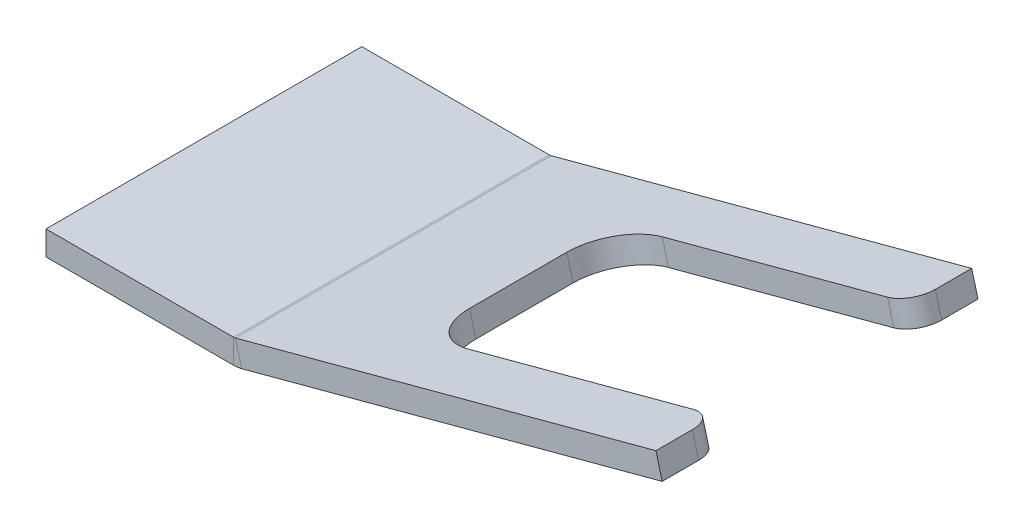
ISO-10303-21;
HEADER;
FILE_DESCRIPTION(('STEP AP214'),'2;1');
FILE_NAME('part.step','',(''),(''),'','','');
FILE_SCHEMA(('AUTOMOTIVE_DESIGN { 1 0 10303 214 1 1 1 1 }'));
ENDSEC;
DATA;
#1=APPLICATION_CONTEXT('core data for automotive mechanical design processes');
#2=APPLICATION_PROTOCOL_DEFINITION('international standard','automotive_design',2000,#1);
#3=PRODUCT_CONTEXT('',#1,'mechanical');
#4=PRODUCT('Part','Part','',(#3));
#5=PRODUCT_RELATED_PRODUCT_CATEGORY('part','',(#4));
#6=PRODUCT_DEFINITION_FORMATION('','',#4);
#7=PRODUCT_DEFINITION_CONTEXT('part definition',#1,'design');
#8=PRODUCT_DEFINITION('design','',#6,#7);
#9=PRODUCT_DEFINITION_SHAPE('','',#8);
#10=(LENGTH_UNIT() NAMED_UNIT(*) SI_UNIT(.MILLI.,.METRE.));
#11=(NAMED_UNIT(*) PLANE_ANGLE_UNIT() SI_UNIT($,.RADIAN.));
#12=(NAMED_UNIT(*) SI_UNIT($,.STERADIAN.) SOLID_ANGLE_UNIT());
#13=UNCERTAINTY_MEASURE_WITH_UNIT(LENGTH_MEASURE(1.E-05),#10,'distance_accuracy_value','');
#14=(GEOMETRIC_REPRESENTATION_CONTEXT(3) GLOBAL_UNCERTAINTY_ASSIGNED_CONTEXT((#13)) GLOBAL_UNIT_ASSIGNED_CONTEXT((#10,
#11,#12)) REPRESENTATION_CONTEXT('',''));
#15=CARTESIAN_POINT('',(0.,0.,0.));
#16=DIRECTION('',(0.,0.,1.));
#17=DIRECTION('',(1.,0.,0.));
#18=AXIS2_PLACEMENT_3D('',#15,#16,#17);
#19=CARTESIAN_POINT('',(57.5140017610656,17.1194629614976,-25.));
#20=DIRECTION('',(-0.258819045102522,0.965925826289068,0.));
#21=DIRECTION('',(0.,0.,1.));
#22=AXIS2_PLACEMENT_3D('',#19,#20,#21);
#23=PLANE('',#22);
#24=DIRECTION('',(0.965925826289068,0.258819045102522,0.));
#25=VECTOR('',#24,1.);
#26=CARTESIAN_POINT('',(-62.2608006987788,-14.9740986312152,32.5));
#27=LINE('',#26,#25);
#28=CARTESIAN_POINT('',(-24.2103752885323,-4.77851787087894,32.5));
#29=VERTEX_POINT('',#28);
#30=CARTESIAN_POINT('',(62.343630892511,18.4135581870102,32.5));
#31=VERTEX_POINT('',#30);
#32=EDGE_CURVE('E52',#29,#31,#27,.T.);
#33=ORIENTED_EDGE('',*,*,#32,.F.);
#34=DIRECTION('',(0.,0.,-1.));
#35=VECTOR('',#34,1.);
#36=CARTESIAN_POINT('',(-24.2103752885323,-4.77851787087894,-25.));
#37=LINE('',#36,#35);
#38=CARTESIAN_POINT('',(-24.2103752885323,-4.77851787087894,-32.5));
#39=VERTEX_POINT('',#38);
#40=EDGE_CURVE('E189',#29,#39,#37,.T.);
#41=ORIENTED_EDGE('',*,*,#40,.T.);
#42=DIRECTION('',(-0.965925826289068,-0.258819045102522,0.));
#43=VECTOR('',#42,1.);
#44=CARTESIAN_POINT('',(-62.2608006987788,-14.9740986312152,-32.5));
#45=LINE('',#44,#43);
#46=CARTESIAN_POINT('',(62.343630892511,18.4135581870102,-32.5));
#47=VERTEX_POINT('',#46);
#48=EDGE_CURVE('E253',#47,#39,#45,.T.);
#49=ORIENTED_EDGE('',*,*,#48,.F.);
#50=DIRECTION('',(0.,0.,-1.));
#51=VECTOR('',#50,1.);
#52=CARTESIAN_POINT('',(62.343630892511,18.4135581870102,-32.5));
#53=LINE('',#52,#51);
#54=CARTESIAN_POINT('',(62.343630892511,18.4135581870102,-25.));
#55=VERTEX_POINT('',#54);
#56=EDGE_CURVE('E249',#55,#47,#53,.T.);
#57=ORIENTED_EDGE('',*,*,#56,.F.);
#58=CARTESIAN_POINT('',(57.5140017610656,17.1194629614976,-25.));
#59=DIRECTION('',(-0.258819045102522,0.965925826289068,0.));
#60=DIRECTION('',(0.,0.,1.));
#61=AXIS2_PLACEMENT_3D('',#58,#59,#60);
#62=CIRCLE('',#61,5.);
#63=CARTESIAN_POINT('',(57.5140017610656,17.1194629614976,-20.));
#64=VERTEX_POINT('',#63);
#65=EDGE_CURVE('E245',#64,#55,#62,.T.);
#66=ORIENTED_EDGE('',*,*,#65,.F.);
#67=DIRECTION('',(0.965925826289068,0.258819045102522,0.));
#68=VECTOR('',#67,1.);
#69=CARTESIAN_POINT('',(57.5140017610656,17.1194629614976,-20.));
#70=LINE('',#69,#68);
#71=CARTESIAN_POINT('',(11.1495620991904,4.69614879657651,-20.));
#72=VERTEX_POINT('',#71);
#73=EDGE_CURVE('E241',#72,#64,#70,.T.);
#74=ORIENTED_EDGE('',*,*,#73,.F.);
#75=CARTESIAN_POINT('',(11.1495620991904,4.69614879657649,-10.));
#76=DIRECTION('',(0.258819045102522,-0.965925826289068,0.));
#77=DIRECTION('',(0.,0.,-1.));
#78=AXIS2_PLACEMENT_3D('',#75,#76,#77);
#79=CIRCLE('',#78,10.);
#80=CARTESIAN_POINT('',(1.49030383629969,2.10795834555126,-9.99999999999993));
#81=VERTEX_POINT('',#80);
#82=EDGE_CURVE('E237',#81,#72,#79,.T.);
#83=ORIENTED_EDGE('',*,*,#82,.F.);
#84=DIRECTION('',(0.,0.,-1.));
#85=VECTOR('',#84,1.);
#86=CARTESIAN_POINT('',(1.49030383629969,2.10795834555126,-9.99999999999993));
#87=LINE('',#86,#85);
#88=CARTESIAN_POINT('',(1.49030383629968,2.10795834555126,9.99999999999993));
#89=VERTEX_POINT('',#88);
#90=EDGE_CURVE('E233',#89,#81,#87,.T.);
#91=ORIENTED_EDGE('',*,*,#90,.F.);
#92=CARTESIAN_POINT('',(11.1495620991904,4.69614879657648,10.));
#93=DIRECTION('',(0.258819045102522,-0.965925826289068,0.));
#94=DIRECTION('',(0.,0.,1.));
#95=AXIS2_PLACEMENT_3D('',#92,#93,#94);
#96=CIRCLE('',#95,10.);
#97=CARTESIAN_POINT('',(11.1495620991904,4.69614879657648,20.));
#98=VERTEX_POINT('',#97);
#99=EDGE_CURVE('E229',#98,#89,#96,.T.);
#100=ORIENTED_EDGE('',*,*,#99,.F.);
#101=DIRECTION('',(-0.965925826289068,-0.258819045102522,0.));
#102=VECTOR('',#101,1.);
#103=CARTESIAN_POINT('',(57.5140017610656,17.1194629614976,20.));
#104=LINE('',#103,#102);
#105=CARTESIAN_POINT('',(57.5140017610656,17.1194629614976,20.));
#106=VERTEX_POINT('',#105);
#107=EDGE_CURVE('E225',#106,#98,#104,.T.);
#108=ORIENTED_EDGE('',*,*,#107,.F.);
#109=CARTESIAN_POINT('',(57.5140017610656,17.1194629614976,25.));
#110=DIRECTION('',(-0.258819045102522,0.965925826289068,0.));
#111=DIRECTION('',(0.,0.,1.));
#112=AXIS2_PLACEMENT_3D('',#109,#110,#111);
#113=CIRCLE('',#112,5.);
#114=CARTESIAN_POINT('',(62.343630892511,18.4135581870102,25.));
#115=VERTEX_POINT('',#114);
#116=EDGE_CURVE('E221',#115,#106,#113,.T.);
#117=ORIENTED_EDGE('',*,*,#116,.F.);
#118=DIRECTION('',(0.,0.,-1.));
#119=VECTOR('',#118,1.);
#120=CARTESIAN_POINT('',(62.343630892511,18.4135581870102,25.));
#121=LINE('',#120,#119);
#122=EDGE_CURVE('E217',#31,#115,#121,.T.);
#123=ORIENTED_EDGE('',*,*,#122,.F.);
#124=EDGE_LOOP('',(#33,#41,#49,#57,#66,#74,#83,#91,#100,#108,#117,#123));
#125=FACE_BOUND('',#124,.T.);
#126=ADVANCED_FACE('F48',(#125),#23,.F.);
#127=CARTESIAN_POINT('',(62.343630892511,18.4135581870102,25.));
#128=DIRECTION('',(0.965925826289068,0.258819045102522,0.));
#129=DIRECTION('',(0.,0.,-1.));
#130=AXIS2_PLACEMENT_3D('',#127,#128,#129);
#131=PLANE('',#130);
#132=DIRECTION('',(0.,0.,-1.));
#133=VECTOR('',#132,1.);
#134=CARTESIAN_POINT('',(61.0495356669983,23.2431873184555,25.));
#135=LINE('',#134,#133);
#136=CARTESIAN_POINT('',(61.0495356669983,23.2431873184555,32.5));
#137=VERTEX_POINT('',#136);
#138=CARTESIAN_POINT('',(61.0495356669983,23.2431873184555,25.));
#139=VERTEX_POINT('',#138);
#140=EDGE_CURVE('E254',#137,#139,#135,.T.);
#141=ORIENTED_EDGE('',*,*,#140,.F.);
#142=DIRECTION('',(-0.258819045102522,0.965925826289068,0.));
#143=VECTOR('',#142,1.);
#144=CARTESIAN_POINT('',(62.343630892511,18.4135581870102,32.5));
#145=LINE('',#144,#143);
#146=EDGE_CURVE('E290',#31,#137,#145,.T.);
#147=ORIENTED_EDGE('',*,*,#146,.F.);
#148=ORIENTED_EDGE('',*,*,#122,.T.);
#149=DIRECTION('',(-0.258819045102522,0.965925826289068,0.));
#150=VECTOR('',#149,1.);
#151=CARTESIAN_POINT('',(62.343630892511,18.4135581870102,25.));
#152=LINE('',#151,#150);
#153=EDGE_CURVE('E316',#115,#139,#152,.T.);
#154=ORIENTED_EDGE('',*,*,#153,.T.);
#155=EDGE_LOOP('',(#141,#147,#148,#154));
#156=FACE_BOUND('',#155,.T.);
#157=ADVANCED_FACE('F336',(#156),#131,.T.);
#158=CARTESIAN_POINT('',(-62.2608006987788,-14.9740986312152,32.5));
#159=DIRECTION('',(0.,0.,1.));
#160=DIRECTION('',(0.965925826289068,0.258819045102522,0.));
#161=AXIS2_PLACEMENT_3D('',#158,#159,#160);
#162=PLANE('',#161);
#163=DIRECTION('',(-0.258819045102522,0.965925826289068,0.));
#164=VECTOR('',#163,1.);
#165=CARTESIAN_POINT('',(-24.2103752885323,-4.77851787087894,32.5));
#166=LINE('',#165,#164);
#167=CARTESIAN_POINT('',(-25.504470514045,0.0511112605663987,32.5));
#168=VERTEX_POINT('',#167);
#169=EDGE_CURVE('E321',#29,#168,#166,.T.);
#170=ORIENTED_EDGE('',*,*,#169,.F.);
#171=ORIENTED_EDGE('',*,*,#32,.T.);
#172=ORIENTED_EDGE('',*,*,#146,.T.);
#173=DIRECTION('',(0.965925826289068,0.258819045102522,0.));
#174=VECTOR('',#173,1.);
#175=CARTESIAN_POINT('',(-63.5548959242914,-10.1444694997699,32.5));
#176=LINE('',#175,#174);
#177=EDGE_CURVE('E74',#168,#137,#176,.T.);
#178=ORIENTED_EDGE('',*,*,#177,.F.);
#179=EDGE_LOOP('',(#170,#171,#172,#178));
#180=FACE_BOUND('',#179,.T.);
#181=ADVANCED_FACE('F333',(#180),#162,.T.);
#182=CARTESIAN_POINT('',(-62.2608006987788,-14.9740986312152,-32.5));
#183=DIRECTION('',(0.,0.,-1.));
#184=DIRECTION('',(-0.965925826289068,-0.258819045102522,0.));
#185=AXIS2_PLACEMENT_3D('',#182,#183,#184);
#186=PLANE('',#185);
#187=DIRECTION('',(0.258819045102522,-0.965925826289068,0.));
#188=VECTOR('',#187,1.);
#189=CARTESIAN_POINT('',(-24.2103752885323,-4.77851787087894,-32.5));
#190=LINE('',#189,#188);
#191=CARTESIAN_POINT('',(-25.504470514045,0.051111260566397,-32.5));
#192=VERTEX_POINT('',#191);
#193=EDGE_CURVE('E12',#192,#39,#190,.T.);
#194=ORIENTED_EDGE('',*,*,#193,.F.);
#195=DIRECTION('',(-0.965925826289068,-0.258819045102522,0.));
#196=VECTOR('',#195,1.);
#197=CARTESIAN_POINT('',(-63.5548959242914,-10.1444694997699,-32.5));
#198=LINE('',#197,#196);
#199=CARTESIAN_POINT('',(61.0495356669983,23.2431873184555,-32.5));
#200=VERTEX_POINT('',#199);
#201=EDGE_CURVE('E66',#200,#192,#198,.T.);
#202=ORIENTED_EDGE('',*,*,#201,.F.);
#203=DIRECTION('',(-0.258819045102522,0.965925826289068,0.));
#204=VECTOR('',#203,1.);
#205=CARTESIAN_POINT('',(62.343630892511,18.4135581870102,-32.5));
#206=LINE('',#205,#204);
#207=EDGE_CURVE('E293',#47,#200,#206,.T.);
#208=ORIENTED_EDGE('',*,*,#207,.F.);
#209=ORIENTED_EDGE('',*,*,#48,.T.);
#210=EDGE_LOOP('',(#194,#202,#208,#209));
#211=FACE_BOUND('',#210,.T.);
#212=ADVANCED_FACE('F50',(#211),#186,.T.);
#213=CARTESIAN_POINT('',(62.343630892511,18.4135581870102,-32.5));
#214=DIRECTION('',(0.965925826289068,0.258819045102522,0.));
#215=DIRECTION('',(0.,0.,-1.));
#216=AXIS2_PLACEMENT_3D('',#213,#214,#215);
#217=PLANE('',#216);
#218=DIRECTION('',(0.,0.,-1.));
#219=VECTOR('',#218,1.);
#220=CARTESIAN_POINT('',(61.0495356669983,23.2431873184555,-32.5));
#221=LINE('',#220,#219);
#222=CARTESIAN_POINT('',(61.0495356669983,23.2431873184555,-25.));
#223=VERTEX_POINT('',#222);
#224=EDGE_CURVE('E287',#223,#200,#221,.T.);
#225=ORIENTED_EDGE('',*,*,#224,.F.);
#226=DIRECTION('',(-0.258819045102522,0.965925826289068,0.));
#227=VECTOR('',#226,1.);
#228=CARTESIAN_POINT('',(62.343630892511,18.4135581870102,-25.));
#229=LINE('',#228,#227);
#230=EDGE_CURVE('E296',#55,#223,#229,.T.);
#231=ORIENTED_EDGE('',*,*,#230,.F.);
#232=ORIENTED_EDGE('',*,*,#56,.T.);
#233=ORIENTED_EDGE('',*,*,#207,.T.);
#234=EDGE_LOOP('',(#225,#231,#232,#233));
#235=FACE_BOUND('',#234,.T.);
#236=ADVANCED_FACE('F367',(#235),#217,.T.);
#237=CARTESIAN_POINT('',(57.5140017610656,17.1194629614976,-25.));
#238=DIRECTION('',(-0.258819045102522,0.965925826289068,0.));
#239=DIRECTION('',(0.,0.,1.));
#240=AXIS2_PLACEMENT_3D('',#237,#238,#239);
#241=CYLINDRICAL_SURFACE('',#240,5.);
#242=CARTESIAN_POINT('',(56.219906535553,21.9490920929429,-25.));
#243=DIRECTION('',(-0.258819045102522,0.965925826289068,0.));
#244=DIRECTION('',(0.,0.,1.));
#245=AXIS2_PLACEMENT_3D('',#242,#243,#244);
#246=CIRCLE('',#245,5.);
#247=CARTESIAN_POINT('',(56.219906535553,21.9490920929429,-20.));
#248=VERTEX_POINT('',#247);
#249=EDGE_CURVE('E283',#248,#223,#246,.T.);
#250=ORIENTED_EDGE('',*,*,#249,.F.);
#251=DIRECTION('',(-0.258819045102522,0.965925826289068,0.));
#252=VECTOR('',#251,1.);
#253=CARTESIAN_POINT('',(57.5140017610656,17.1194629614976,-20.));
#254=LINE('',#253,#252);
#255=EDGE_CURVE('E299',#64,#248,#254,.T.);
#256=ORIENTED_EDGE('',*,*,#255,.F.);
#257=ORIENTED_EDGE('',*,*,#65,.T.);
#258=ORIENTED_EDGE('',*,*,#230,.T.);
#259=EDGE_LOOP('',(#250,#256,#257,#258));
#260=FACE_BOUND('',#259,.T.);
#261=ADVANCED_FACE('F364',(#260),#241,.T.);
#262=CARTESIAN_POINT('',(57.5140017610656,17.1194629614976,-20.));
#263=DIRECTION('',(0.,0.,1.));
#264=DIRECTION('',(0.965925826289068,0.258819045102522,0.));
#265=AXIS2_PLACEMENT_3D('',#262,#263,#264);
#266=PLANE('',#265);
#267=DIRECTION('',(0.965925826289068,0.258819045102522,0.));
#268=VECTOR('',#267,1.);
#269=CARTESIAN_POINT('',(56.219906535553,21.9490920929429,-20.));
#270=LINE('',#269,#268);
#271=CARTESIAN_POINT('',(9.85546687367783,9.52577792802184,-20.));
#272=VERTEX_POINT('',#271);
#273=EDGE_CURVE('E279',#272,#248,#270,.T.);
#274=ORIENTED_EDGE('',*,*,#273,.F.);
#275=DIRECTION('',(-0.258819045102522,0.965925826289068,0.));
#276=VECTOR('',#275,1.);
#277=CARTESIAN_POINT('',(11.1495620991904,4.69614879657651,-20.));
#278=LINE('',#277,#276);
#279=EDGE_CURVE('E302',#72,#272,#278,.T.);
#280=ORIENTED_EDGE('',*,*,#279,.F.);
#281=ORIENTED_EDGE('',*,*,#73,.T.);
#282=ORIENTED_EDGE('',*,*,#255,.T.);
#283=EDGE_LOOP('',(#274,#280,#281,#282));
#284=FACE_BOUND('',#283,.T.);
#285=ADVANCED_FACE('F360',(#284),#266,.T.);
#286=CARTESIAN_POINT('',(11.1495620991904,4.69614879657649,-10.));
#287=DIRECTION('',(-0.258819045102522,0.965925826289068,0.));
#288=DIRECTION('',(0.,0.,1.));
#289=AXIS2_PLACEMENT_3D('',#286,#287,#288);
#290=CYLINDRICAL_SURFACE('',#289,10.);
#291=CARTESIAN_POINT('',(9.85546687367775,9.52577792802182,-10.));
#292=DIRECTION('',(0.258819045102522,-0.965925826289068,0.));
#293=DIRECTION('',(0.,0.,-1.));
#294=AXIS2_PLACEMENT_3D('',#291,#292,#293);
#295=CIRCLE('',#294,10.);
#296=CARTESIAN_POINT('',(0.196208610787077,6.9375874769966,-9.99999999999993));
#297=VERTEX_POINT('',#296);
#298=EDGE_CURVE('E275',#297,#272,#295,.T.);
#299=ORIENTED_EDGE('',*,*,#298,.F.);
#300=DIRECTION('',(-0.258819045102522,0.965925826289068,0.));
#301=VECTOR('',#300,1.);
#302=CARTESIAN_POINT('',(1.49030383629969,2.10795834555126,-9.99999999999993));
#303=LINE('',#302,#301);
#304=EDGE_CURVE('E305',#81,#297,#303,.T.);
#305=ORIENTED_EDGE('',*,*,#304,.F.);
#306=ORIENTED_EDGE('',*,*,#82,.T.);
#307=ORIENTED_EDGE('',*,*,#279,.T.);
#308=EDGE_LOOP('',(#299,#305,#306,#307));
#309=FACE_BOUND('',#308,.T.);
#310=ADVANCED_FACE('F356',(#309),#290,.F.);
#311=CARTESIAN_POINT('',(1.49030383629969,2.10795834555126,-9.99999999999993));
#312=DIRECTION('',(0.965925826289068,0.258819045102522,0.));
#313=DIRECTION('',(0.,0.,-1.));
#314=AXIS2_PLACEMENT_3D('',#311,#312,#313);
#315=PLANE('',#314);
#316=DIRECTION('',(0.,0.,-1.));
#317=VECTOR('',#316,1.);
#318=CARTESIAN_POINT('',(0.196208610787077,6.9375874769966,-9.99999999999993));
#319=LINE('',#318,#317);
#320=CARTESIAN_POINT('',(0.196208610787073,6.9375874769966,9.99999999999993));
#321=VERTEX_POINT('',#320);
#322=EDGE_CURVE('E271',#321,#297,#319,.T.);
#323=ORIENTED_EDGE('',*,*,#322,.F.);
#324=DIRECTION('',(-0.258819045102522,0.965925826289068,0.));
#325=VECTOR('',#324,1.);
#326=CARTESIAN_POINT('',(1.49030383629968,2.10795834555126,9.99999999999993));
#327=LINE('',#326,#325);
#328=EDGE_CURVE('E308',#89,#321,#327,.T.);
#329=ORIENTED_EDGE('',*,*,#328,.F.);
#330=ORIENTED_EDGE('',*,*,#90,.T.);
#331=ORIENTED_EDGE('',*,*,#304,.T.);
#332=EDGE_LOOP('',(#323,#329,#330,#331));
#333=FACE_BOUND('',#332,.T.);
#334=ADVANCED_FACE('F352',(#333),#315,.T.);
#335=CARTESIAN_POINT('',(11.1495620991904,4.69614879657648,10.));
#336=DIRECTION('',(-0.258819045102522,0.965925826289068,0.));
#337=DIRECTION('',(0.,0.,1.));
#338=AXIS2_PLACEMENT_3D('',#335,#336,#337);
#339=CYLINDRICAL_SURFACE('',#338,10.);
#340=CARTESIAN_POINT('',(9.85546687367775,9.52577792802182,10.));
#341=DIRECTION('',(0.258819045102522,-0.965925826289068,0.));
#342=DIRECTION('',(0.,0.,1.));
#343=AXIS2_PLACEMENT_3D('',#340,#341,#342);
#344=CIRCLE('',#343,10.);
#345=CARTESIAN_POINT('',(9.85546687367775,9.52577792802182,20.));
#346=VERTEX_POINT('',#345);
#347=EDGE_CURVE('E267',#346,#321,#344,.T.);
#348=ORIENTED_EDGE('',*,*,#347,.F.);
#349=DIRECTION('',(-0.258819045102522,0.965925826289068,0.));
#350=VECTOR('',#349,1.);
#351=CARTESIAN_POINT('',(11.1495620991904,4.69614879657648,20.));
#352=LINE('',#351,#350);
#353=EDGE_CURVE('E310',#98,#346,#352,.T.);
#354=ORIENTED_EDGE('',*,*,#353,.F.);
#355=ORIENTED_EDGE('',*,*,#99,.T.);
#356=ORIENTED_EDGE('',*,*,#328,.T.);
#357=EDGE_LOOP('',(#348,#354,#355,#356));
#358=FACE_BOUND('',#357,.T.);
#359=ADVANCED_FACE('F348',(#358),#339,.F.);
#360=CARTESIAN_POINT('',(57.5140017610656,17.1194629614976,20.));
#361=DIRECTION('',(0.,0.,-1.));
#362=DIRECTION('',(-0.965925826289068,-0.258819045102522,0.));
#363=AXIS2_PLACEMENT_3D('',#360,#361,#362);
#364=PLANE('',#363);
#365=DIRECTION('',(-0.965925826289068,-0.258819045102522,0.));
#366=VECTOR('',#365,1.);
#367=CARTESIAN_POINT('',(56.219906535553,21.9490920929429,20.));
#368=LINE('',#367,#366);
#369=CARTESIAN_POINT('',(56.219906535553,21.9490920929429,20.));
#370=VERTEX_POINT('',#369);
#371=EDGE_CURVE('E263',#370,#346,#368,.T.);
#372=ORIENTED_EDGE('',*,*,#371,.F.);
#373=DIRECTION('',(-0.258819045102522,0.965925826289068,0.));
#374=VECTOR('',#373,1.);
#375=CARTESIAN_POINT('',(57.5140017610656,17.1194629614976,20.));
#376=LINE('',#375,#374);
#377=EDGE_CURVE('E313',#106,#370,#376,.T.);
#378=ORIENTED_EDGE('',*,*,#377,.F.);
#379=ORIENTED_EDGE('',*,*,#107,.T.);
#380=ORIENTED_EDGE('',*,*,#353,.T.);
#381=EDGE_LOOP('',(#372,#378,#379,#380));
#382=FACE_BOUND('',#381,.T.);
#383=ADVANCED_FACE('F344',(#382),#364,.T.);
#384=CARTESIAN_POINT('',(57.5140017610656,17.1194629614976,25.));
#385=DIRECTION('',(-0.258819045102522,0.965925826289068,0.));
#386=DIRECTION('',(0.,0.,1.));
#387=AXIS2_PLACEMENT_3D('',#384,#385,#386);
#388=CYLINDRICAL_SURFACE('',#387,5.);
#389=CARTESIAN_POINT('',(56.219906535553,21.9490920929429,25.));
#390=DIRECTION('',(-0.258819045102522,0.965925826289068,0.));
#391=DIRECTION('',(0.,0.,1.));
#392=AXIS2_PLACEMENT_3D('',#389,#390,#391);
#393=CIRCLE('',#392,5.);
#394=EDGE_CURVE('E258',#139,#370,#393,.T.);
#395=ORIENTED_EDGE('',*,*,#394,.F.);
#396=ORIENTED_EDGE('',*,*,#153,.F.);
#397=ORIENTED_EDGE('',*,*,#116,.T.);
#398=ORIENTED_EDGE('',*,*,#377,.T.);
#399=EDGE_LOOP('',(#395,#396,#397,#398));
#400=FACE_BOUND('',#399,.T.);
#401=ADVANCED_FACE('F340',(#400),#388,.T.);
#402=CARTESIAN_POINT('',(56.219906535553,21.9490920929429,-25.));
#403=DIRECTION('',(-0.258819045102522,0.965925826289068,0.));
#404=DIRECTION('',(0.,0.,1.));
#405=AXIS2_PLACEMENT_3D('',#402,#403,#404);
#406=PLANE('',#405);
#407=DIRECTION('',(0.,0.,-1.));
#408=VECTOR('',#407,1.);
#409=CARTESIAN_POINT('',(-25.504470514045,0.0511112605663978,-25.));
#410=LINE('',#409,#408);
#411=EDGE_CURVE('E58',#168,#192,#410,.T.);
#412=ORIENTED_EDGE('',*,*,#411,.F.);
#413=ORIENTED_EDGE('',*,*,#177,.T.);
#414=ORIENTED_EDGE('',*,*,#140,.T.);
#415=ORIENTED_EDGE('',*,*,#394,.T.);
#416=ORIENTED_EDGE('',*,*,#371,.T.);
#417=ORIENTED_EDGE('',*,*,#347,.T.);
#418=ORIENTED_EDGE('',*,*,#322,.T.);
#419=ORIENTED_EDGE('',*,*,#298,.T.);
#420=ORIENTED_EDGE('',*,*,#273,.T.);
#421=ORIENTED_EDGE('',*,*,#249,.T.);
#422=ORIENTED_EDGE('',*,*,#224,.T.);
#423=ORIENTED_EDGE('',*,*,#201,.T.);
#424=EDGE_LOOP('',(#412,#413,#414,#415,#416,#417,#418,#419,#420,#421,#422,#423));
#425=FACE_BOUND('',#424,.T.);
#426=ADVANCED_FACE('F330',(#425),#406,.T.);
#427=CARTESIAN_POINT('',(-64.5,-5.,-32.5));
#428=DIRECTION('',(-1.,0.,0.));
#429=DIRECTION('',(0.,0.,1.));
#430=AXIS2_PLACEMENT_3D('',#427,#428,#429);
#431=PLANE('',#430);
#432=DIRECTION('',(0.,0.,1.));
#433=VECTOR('',#432,1.);
#434=CARTESIAN_POINT('',(-64.5,0.,-32.5));
#435=LINE('',#434,#433);
#436=CARTESIAN_POINT('',(-64.5,0.,-32.5));
#437=VERTEX_POINT('',#436);
#438=CARTESIAN_POINT('',(-64.5,0.,32.5));
#439=VERTEX_POINT('',#438);
#440=EDGE_CURVE('E396',#437,#439,#435,.T.);
#441=ORIENTED_EDGE('',*,*,#440,.F.);
#442=DIRECTION('',(0.,1.,0.));
#443=VECTOR('',#442,1.);
#444=CARTESIAN_POINT('',(-64.5,-5.,-32.5));
#445=LINE('',#444,#443);
#446=CARTESIAN_POINT('',(-64.5,-5.,-32.5));
#447=VERTEX_POINT('',#446);
#448=EDGE_CURVE('E259',#447,#437,#445,.T.);
#449=ORIENTED_EDGE('',*,*,#448,.F.);
#450=DIRECTION('',(0.,0.,1.));
#451=VECTOR('',#450,1.);
#452=CARTESIAN_POINT('',(-64.5,-5.,-32.5));
#453=LINE('',#452,#451);
#454=CARTESIAN_POINT('',(-64.5,-5.,32.5));
#455=VERTEX_POINT('',#454);
#456=EDGE_CURVE('E202',#447,#455,#453,.T.);
#457=ORIENTED_EDGE('',*,*,#456,.T.);
#458=DIRECTION('',(0.,1.,0.));
#459=VECTOR('',#458,1.);
#460=CARTESIAN_POINT('',(-64.5,-5.,32.5));
#461=LINE('',#460,#459);
#462=EDGE_CURVE('E205',#455,#439,#461,.T.);
#463=ORIENTED_EDGE('',*,*,#462,.T.);
#464=EDGE_LOOP('',(#441,#449,#457,#463));
#465=FACE_BOUND('',#464,.T.);
#466=ADVANCED_FACE('F409',(#465),#431,.T.);
#467=CARTESIAN_POINT('',(59.5,-5.,-25.));
#468=DIRECTION('',(0.,1.,0.));
#469=DIRECTION('',(0.,0.,1.));
#470=AXIS2_PLACEMENT_3D('',#467,#468,#469);
#471=PLANE('',#470);
#472=DIRECTION('',(0.,0.,-1.));
#473=VECTOR('',#472,1.);
#474=CARTESIAN_POINT('',(-25.8926990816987,-5.,-25.));
#475=LINE('',#474,#473);
#476=CARTESIAN_POINT('',(-25.8926990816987,-5.,32.5));
#477=VERTEX_POINT('',#476);
#478=CARTESIAN_POINT('',(-25.8926990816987,-5.,-32.5));
#479=VERTEX_POINT('',#478);
#480=EDGE_CURVE('E186',#477,#479,#475,.T.);
#481=ORIENTED_EDGE('',*,*,#480,.F.);
#482=DIRECTION('',(1.,0.,0.));
#483=VECTOR('',#482,1.);
#484=CARTESIAN_POINT('',(-64.5,-5.,32.5));
#485=LINE('',#484,#483);
#486=EDGE_CURVE('E180',#455,#477,#485,.T.);
#487=ORIENTED_EDGE('',*,*,#486,.F.);
#488=ORIENTED_EDGE('',*,*,#456,.F.);
#489=DIRECTION('',(-1.,0.,0.));
#490=VECTOR('',#489,1.);
#491=CARTESIAN_POINT('',(-64.5,-5.,-32.5));
#492=LINE('',#491,#490);
#493=EDGE_CURVE('E199',#479,#447,#492,.T.);
#494=ORIENTED_EDGE('',*,*,#493,.F.);
#495=EDGE_LOOP('',(#481,#487,#488,#494));
#496=FACE_BOUND('',#495,.T.);
#497=ADVANCED_FACE('F197',(#496),#471,.F.);
#498=CARTESIAN_POINT('',(-64.5,-5.,32.5));
#499=DIRECTION('',(0.,0.,1.));
#500=DIRECTION('',(1.,0.,0.));
#501=AXIS2_PLACEMENT_3D('',#498,#499,#500);
#502=PLANE('',#501);
#503=ORIENTED_EDGE('',*,*,#486,.T.);
#504=DIRECTION('',(0.,1.,0.));
#505=VECTOR('',#504,1.);
#506=CARTESIAN_POINT('',(-25.8926990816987,-5.,32.5));
#507=LINE('',#506,#505);
#508=CARTESIAN_POINT('',(-25.8926990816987,0.,32.5));
#509=VERTEX_POINT('',#508);
#510=EDGE_CURVE('E166',#477,#509,#507,.T.);
#511=ORIENTED_EDGE('',*,*,#510,.T.);
#512=DIRECTION('',(1.,0.,0.));
#513=VECTOR('',#512,1.);
#514=CARTESIAN_POINT('',(-64.5,0.,32.5));
#515=LINE('',#514,#513);
#516=EDGE_CURVE('E179',#439,#509,#515,.T.);
#517=ORIENTED_EDGE('',*,*,#516,.F.);
#518=ORIENTED_EDGE('',*,*,#462,.F.);
#519=EDGE_LOOP('',(#503,#511,#517,#518));
#520=FACE_BOUND('',#519,.T.);
#521=ADVANCED_FACE('F204',(#520),#502,.T.);
#522=CARTESIAN_POINT('',(59.5,0.,-25.));
#523=DIRECTION('',(0.,1.,0.));
#524=DIRECTION('',(0.,0.,1.));
#525=AXIS2_PLACEMENT_3D('',#522,#523,#524);
#526=PLANE('',#525);
#527=ORIENTED_EDGE('',*,*,#516,.T.);
#528=DIRECTION('',(0.,0.,-1.));
#529=VECTOR('',#528,1.);
#530=CARTESIAN_POINT('',(-25.8926990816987,0.,-25.));
#531=LINE('',#530,#529);
#532=CARTESIAN_POINT('',(-25.8926990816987,0.,-32.5));
#533=VERTEX_POINT('',#532);
#534=EDGE_CURVE('E382',#509,#533,#531,.T.);
#535=ORIENTED_EDGE('',*,*,#534,.T.);
#536=DIRECTION('',(-1.,0.,0.));
#537=VECTOR('',#536,1.);
#538=CARTESIAN_POINT('',(-64.5,0.,-32.5));
#539=LINE('',#538,#537);
#540=EDGE_CURVE('E400',#533,#437,#539,.T.);
#541=ORIENTED_EDGE('',*,*,#540,.T.);
#542=ORIENTED_EDGE('',*,*,#440,.T.);
#543=EDGE_LOOP('',(#527,#535,#541,#542));
#544=FACE_BOUND('',#543,.T.);
#545=ADVANCED_FACE('F405',(#544),#526,.T.);
#546=CARTESIAN_POINT('',(-64.5,-5.,-32.5));
#547=DIRECTION('',(0.,0.,-1.));
#548=DIRECTION('',(-1.,0.,0.));
#549=AXIS2_PLACEMENT_3D('',#546,#547,#548);
#550=PLANE('',#549);
#551=ORIENTED_EDGE('',*,*,#540,.F.);
#552=DIRECTION('',(0.,-1.,0.));
#553=VECTOR('',#552,1.);
#554=CARTESIAN_POINT('',(-25.8926990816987,-5.,-32.5));
#555=LINE('',#554,#553);
#556=EDGE_CURVE('E375',#533,#479,#555,.T.);
#557=ORIENTED_EDGE('',*,*,#556,.T.);
#558=ORIENTED_EDGE('',*,*,#493,.T.);
#559=ORIENTED_EDGE('',*,*,#448,.T.);
#560=EDGE_LOOP('',(#551,#557,#558,#559));
#561=FACE_BOUND('',#560,.T.);
#562=ADVANCED_FACE('F411',(#561),#550,.T.);
#563=CARTESIAN_POINT('',(-25.8926990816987,1.5,32.5));
#564=DIRECTION('',(0.,0.,1.));
#565=DIRECTION('',(1.,0.,0.));
#566=AXIS2_PLACEMENT_3D('',#563,#564,#565);
#567=PLANE('',#566);
#568=ORIENTED_EDGE('',*,*,#169,.T.);
#569=CARTESIAN_POINT('',(-25.8926990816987,1.5,32.5));
#570=DIRECTION('',(0.,0.,1.));
#571=DIRECTION('',(1.,0.,0.));
#572=AXIS2_PLACEMENT_3D('',#569,#570,#571);
#573=CIRCLE('',#572,1.5);
#574=EDGE_CURVE('E173',#168,#509,#573,.F.);
#575=ORIENTED_EDGE('',*,*,#574,.T.);
#576=ORIENTED_EDGE('',*,*,#510,.F.);
#577=CARTESIAN_POINT('',(-25.8926990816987,1.5,32.5));
#578=DIRECTION('',(0.,0.,-1.));
#579=DIRECTION('',(1.,0.,0.));
#580=AXIS2_PLACEMENT_3D('',#577,#578,#579);
#581=CIRCLE('',#580,6.5);
#582=EDGE_CURVE('E170',#29,#477,#581,.T.);
#583=ORIENTED_EDGE('',*,*,#582,.F.);
#584=EDGE_LOOP('',(#568,#575,#576,#583));
#585=FACE_BOUND('',#584,.T.);
#586=ADVANCED_FACE('F169',(#585),#567,.T.);
#587=CARTESIAN_POINT('',(-25.8926990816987,1.5,-32.5));
#588=DIRECTION('',(0.,0.,-1.));
#589=DIRECTION('',(-1.,0.,0.));
#590=AXIS2_PLACEMENT_3D('',#587,#588,#589);
#591=PLANE('',#590);
#592=ORIENTED_EDGE('',*,*,#556,.F.);
#593=CARTESIAN_POINT('',(-25.8926990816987,1.5,-32.5));
#594=DIRECTION('',(0.,0.,1.));
#595=DIRECTION('',(1.,0.,0.));
#596=AXIS2_PLACEMENT_3D('',#593,#594,#595);
#597=CIRCLE('',#596,1.5);
#598=EDGE_CURVE('E192',#533,#192,#597,.T.);
#599=ORIENTED_EDGE('',*,*,#598,.T.);
#600=ORIENTED_EDGE('',*,*,#193,.T.);
#601=CARTESIAN_POINT('',(-25.8926990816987,1.5,-32.5));
#602=DIRECTION('',(0.,0.,1.));
#603=DIRECTION('',(-1.,0.,0.));
#604=AXIS2_PLACEMENT_3D('',#601,#602,#603);
#605=CIRCLE('',#604,6.5);
#606=EDGE_CURVE('E191',#479,#39,#605,.T.);
#607=ORIENTED_EDGE('',*,*,#606,.F.);
#608=EDGE_LOOP('',(#592,#599,#600,#607));
#609=FACE_BOUND('',#608,.T.);
#610=ADVANCED_FACE('F374',(#609),#591,.T.);
#611=CARTESIAN_POINT('',(-25.8926990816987,1.5,-65.1967549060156));
#612=DIRECTION('',(0.,0.,1.));
#613=DIRECTION('',(1.,0.,0.));
#614=AXIS2_PLACEMENT_3D('',#611,#612,#613);
#615=CYLINDRICAL_SURFACE('',#614,6.5);
#616=ORIENTED_EDGE('',*,*,#606,.T.);
#617=ORIENTED_EDGE('',*,*,#40,.F.);
#618=ORIENTED_EDGE('',*,*,#582,.T.);
#619=ORIENTED_EDGE('',*,*,#480,.T.);
#620=EDGE_LOOP('',(#616,#617,#618,#619));
#621=FACE_BOUND('',#620,.T.);
#622=ADVANCED_FACE('F185',(#621),#615,.T.);
#623=CARTESIAN_POINT('',(-25.8926990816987,1.5,-65.1967549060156));
#624=DIRECTION('',(0.,0.,1.));
#625=DIRECTION('',(1.,0.,0.));
#626=AXIS2_PLACEMENT_3D('',#623,#624,#625);
#627=CYLINDRICAL_SURFACE('',#626,1.5);
#628=ORIENTED_EDGE('',*,*,#598,.F.);
#629=ORIENTED_EDGE('',*,*,#534,.F.);
#630=ORIENTED_EDGE('',*,*,#574,.F.);
#631=ORIENTED_EDGE('',*,*,#411,.T.);
#632=EDGE_LOOP('',(#628,#629,#630,#631));
#633=FACE_BOUND('',#632,.T.);
#634=ADVANCED_FACE('F380',(#633),#627,.F.);
#635=CLOSED_SHELL('',(#126,#157,#181,#212,#236,#261,#285,#310,#334,#359,#383,#401,#426,#466,
#497,#521,#545,#562,#586,#610,#622,#634));
#636=MANIFOLD_SOLID_BREP('B2',#635);
#637=ADVANCED_BREP_SHAPE_REPRESENTATION('',(#18,#636),#14);
#638=SHAPE_DEFINITION_REPRESENTATION(#9,#637);
ENDSEC;
END-ISO-10303-21;
